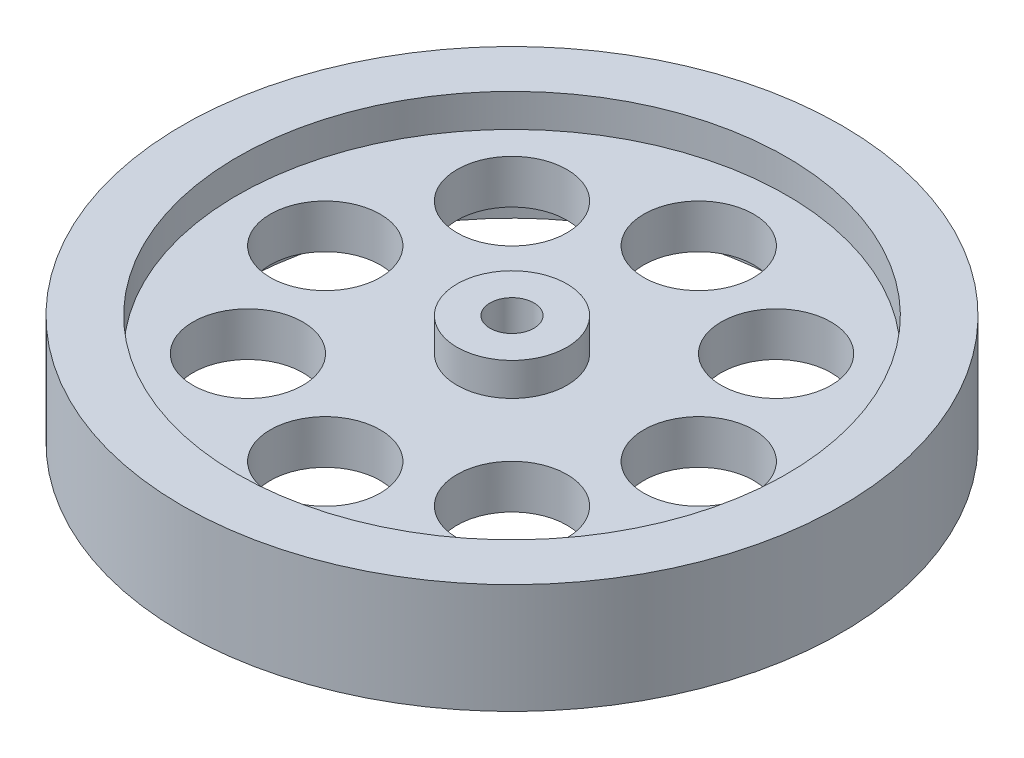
from build123d import *

# Parameters (mm, degrees)
SKETCH2_R          = 5
CUT_EXTRUDE2_DEPTH = 44


with BuildPart() as part:
    # Sketch1 → Revolve1 (revolve)
    with BuildSketch(Plane.XY, mode=Mode.PRIVATE) as revolve1_sk:
        Polygon((-30, 10), (-30, 0), (-25, 0), (-25, 3), (-5, 3), (-5, 0), (-3, 0), (-1.5, 1.5), (-1.5, 4), (-2, 4), (-2, 10), (-5, 10), (-5, 7), (-25, 7), (-25, 10), align=None)
    revolve(revolve1_sk.sketch.rotate(Axis((0, 0, 0), (0, -1, 0)), 270), axis=Axis((0, 0, 0), (0, -1, 0)))

    # Sketch2 → Cut-Extrude2 (cut, through all)
    with BuildSketch(Plane.XZ.offset(-3)):
        with Locations(Location((-17, 0, 0), (0, 0, 270))):
            Circle(SKETCH2_R)
        with Locations(Location((-12.02081528, 12.02081528, 0), (0, 0, 270))):
            Circle(SKETCH2_R)
        with Locations(Location((0, 17, 0), (0, 0, 270))):
            Circle(SKETCH2_R)
        with Locations(Location((12.02081528, 12.02081528, 0), (0, 0, 270))):
            Circle(SKETCH2_R)
        with Locations(Location((17, 0, 0), (0, 0, 270))):
            Circle(SKETCH2_R)
        with Locations(Location((12.02081528, -12.02081528, 0), (0, 0, 270))):
            Circle(SKETCH2_R)
        with Locations(Location((0, -17, 0), (0, 0, 270))):
            Circle(SKETCH2_R)
        with Locations(Location((-12.02081528, -12.02081528, 0), (0, 0, 270))):
            Circle(SKETCH2_R)
    extrude(amount=-CUT_EXTRUDE2_DEPTH, mode=Mode.SUBTRACT)


solid = part.part
